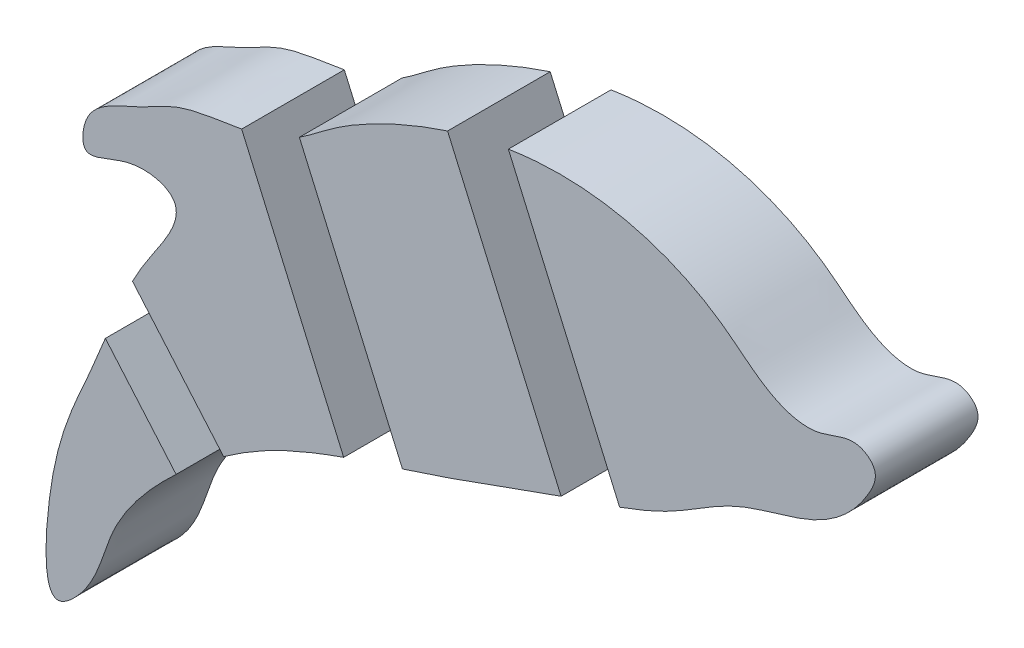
from build123d import *

# Parameters (mm, degrees)
SALIENTE_EXTRUIR1_DEPTH      = 5
SALIENTE_EXTRUIR1_DEPTH_BACK = 5
CORTAR_EXTRUIR1_DEPTH        = 5
CORTAR_EXTRUIR1_DEPTH_BACK   = 120.593041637


with BuildPart() as part:
    # Croquis1 → Saliente-Extruir1 (new, two sides: drawn at the far end of the back side and taken through both)
    with BuildSketch(Plane.XY.offset(-SALIENTE_EXTRUIR1_DEPTH_BACK)):
        with BuildLine():
            add(Edge.make_bspline(
                [(37.120305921, 62.239627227), (38.859537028, 63.073770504), (42.070684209, 65.873593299), (48.087250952, 69.124705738), (54.923461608, 71.663386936), (63.310493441, 73.128814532), (72.129877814, 72.208862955), (79.793128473, 68.490960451), (84.378691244, 64.063245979), (89.371294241, 62.92173436), (92.637942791, 65.139006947), (95.27866067, 63.04364171), (93.456634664, 59.09197994), (89.083616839, 55.270222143), (81.339323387, 54.011666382), (74.268122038, 48.776721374), (63.859053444, 45.672520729), (50.750427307, 40.500091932), (36.715884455, 36.763379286), (26.506999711, 29.02023754), (20.072293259, 21.656109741), (19.000021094, 15.354531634), (13.68622876, 10.350675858), (14.128648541, 25.07447958), (17.459481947, 30.718962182), (20.950448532, 39.703910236), (23.187520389, 44.888407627), (28.815258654, 51.946359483), (22.12552427, 53.5459282), (17.431404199, 50.371226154), (17.699935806, 55.944312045), (22.393593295, 57.275136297), (27.204730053, 60.335302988), (32.308636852, 60.722592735), (35.866097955, 61.63810329), (37.120305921, 62.239627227)],
                knots=[0, 0, 0, 0, 0.024906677, 0.053275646, 0.087291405, 0.117629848, 0.161501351, 0.198152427, 0.224436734, 0.241781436, 0.259585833, 0.266970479, 0.277332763, 0.306822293, 0.341426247, 0.373308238, 0.417622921, 0.478815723, 0.554553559, 0.599500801, 0.642365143, 0.672980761, 0.68432144, 0.716301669, 0.779583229, 0.803577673, 0.832315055, 0.862053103, 0.88194597, 0.899997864, 0.908334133, 0.936543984, 0.953631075, 0.982039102, 1, 1, 1, 1], degree=3))
        make_face()
    extrude(amount=SALIENTE_EXTRUIR1_DEPTH + SALIENTE_EXTRUIR1_DEPTH_BACK)

    # Croquis2 → Cortar-Extruir1 (cut, two sides: drawn at the far end of the back side and taken through both)
    with BuildSketch(Plane.XY.offset(-CORTAR_EXTRUIR1_DEPTH_BACK)):
        Polygon((16.662016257, 40.369982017), (28.817966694, 26.200944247), (33.371749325, 30.107741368), (21.215798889, 44.276779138), align=None)
        Polygon((31.939151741, 63.604367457), (45.14161231, 33.410304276), (50.639053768, 35.814079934), (37.436593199, 66.008143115), align=None)
        Polygon((52.800684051, 71.637044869), (65.603365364, 42.357277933), (71.100806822, 44.761053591), (58.298125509, 74.040820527), align=None)
    extrude(amount=CORTAR_EXTRUIR1_DEPTH + CORTAR_EXTRUIR1_DEPTH_BACK, mode=Mode.SUBTRACT)


with BuildPart() as cortar_extruir1_piece_1:
    # of the separate pieces the step leaves, piece 1, a body of its own (cortar_extruir1_pieces)
    add(part.part.solids().sort_by_distance((59.050323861, 72.320540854, 0))[0])


with BuildPart() as cortar_extruir1_piece_2:
    # of the separate pieces the step leaves, piece 2, a body of its own (cortar_extruir1_pieces)
    add(part.part.solids().sort_by_distance((38.690591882, 63.14024472, 0))[0])


with BuildPart() as cortar_extruir1_piece_3:
    # of the separate pieces the step leaves, piece 3, a body of its own (cortar_extruir1_pieces)
    add(part.part.solids().sort_by_distance((33.068786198, 61.020890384, 5))[0])


with BuildPart() as cortar_extruir1_piece_4:
    # of the separate pieces the step leaves, piece 4, a body of its own (cortar_extruir1_pieces)
    add(part.part.solids().sort_by_distance((19.79043208, 36.723484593, 5))[0])


solid = Compound([cortar_extruir1_piece_1.part, cortar_extruir1_piece_2.part, cortar_extruir1_piece_3.part, cortar_extruir1_piece_4.part])
